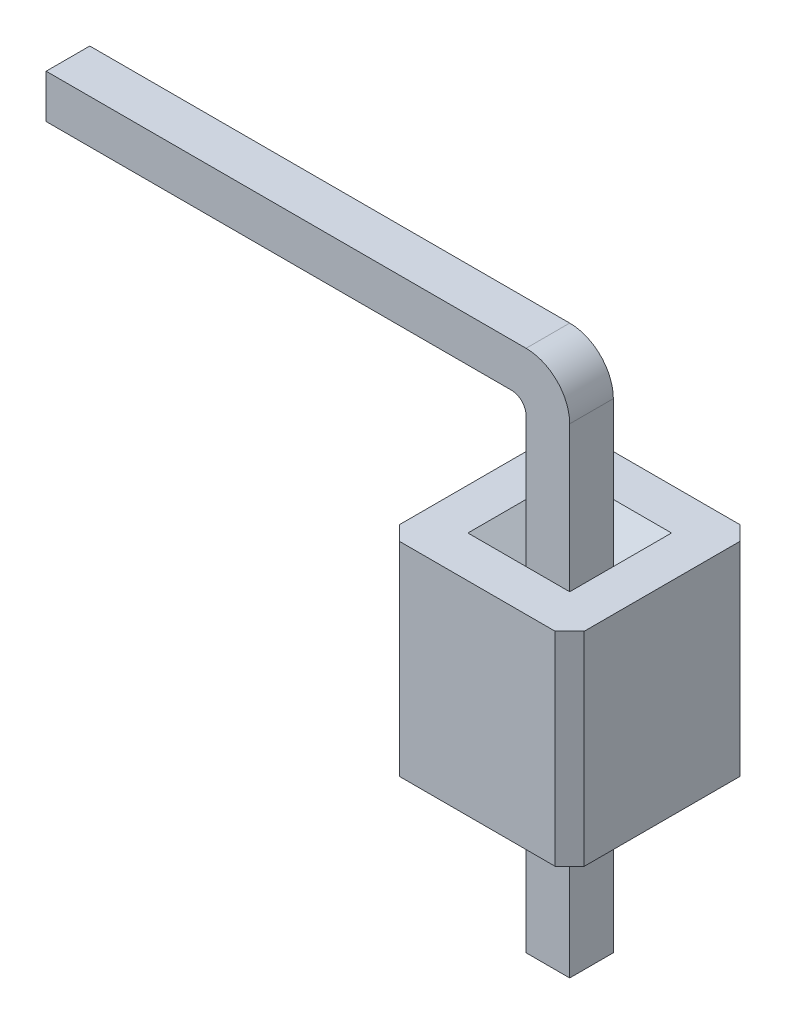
from build123d import *

# Parameters (mm, degrees)
ESQUISSE1_W           = 0.6
ESQUISSE1_H           = 0.6
EXTRUSION1_DEPTH      = 2.8
CHANFREIN1_SIZE       = 0.4
EXTRUSION2_DEPTH      = 5
EXTRUSION2_DEPTH_BACK = 2.2
ESQUISSE2_W           = 0.6
ESQUISSE2_H           = 0.6
ESQUISSE3_W           = 0.6
ESQUISSE3_H           = 0.6
EXTRUSION3_DEPTH      = 6.6
CONG_1_R              = 0.6
CONG_2_R              = 0.2


with BuildPart() as part:
    # Esquisse1 → Extrusion1 (new body)
    with BuildSketch(Plane(origin=(0, 0, 0), x_dir=(1, 0, 0), z_dir=(0, 1, 0))):
        Polygon((1.27, 1.07), (1.27, -1.07), (1.07, -1.27), (-1.07, -1.27), (-1.27, -1.07), (-1.27, 1.07), (-1.07, 1.27), (1.07, 1.27), align=None)
        Rectangle(ESQUISSE1_W, ESQUISSE1_H, mode=Mode.SUBTRACT)
    extrude(amount=EXTRUSION1_DEPTH)

    # Chanfrein1
    chanfrein1_edges = [part.edges().sort_by_distance(p)[0] for p in [
        (-0.3, 2.8, 0),
        (0, 2.8, 0.3),
        (0.3, 2.8, 0),
        (0, 2.8, -0.3),
    ]]
    chamfer(chanfrein1_edges, length=CHANFREIN1_SIZE)

    # Esquisse2 → Extrusion2 (add, two sides: drawn at the far end of the back side and taken through both)
    with BuildSketch(Plane.XZ.offset(-2.8).offset(-EXTRUSION2_DEPTH_BACK)):
        Rectangle(ESQUISSE2_W, ESQUISSE2_H)
    extrude(amount=EXTRUSION2_DEPTH + EXTRUSION2_DEPTH_BACK)

    # Esquisse3 → Extrusion3 (add)
    with BuildSketch(Plane.ZY.offset(0.3)):
        with Locations((0, 4.7)):
            Rectangle(ESQUISSE3_W, ESQUISSE3_H)
    extrude(amount=EXTRUSION3_DEPTH)

    # Cong_1
    cong_1_edges = [part.edges().sort_by_distance(p)[0] for p in [
        (0.3, 5, 0),
    ]]
    fillet(cong_1_edges, radius=CONG_1_R)

    # Cong_2
    cong_2_edges = [part.edges().sort_by_distance(p)[0] for p in [
        (-0.3, 4.4, 0),
    ]]
    fillet(cong_2_edges, radius=CONG_2_R)


solid = part.part
